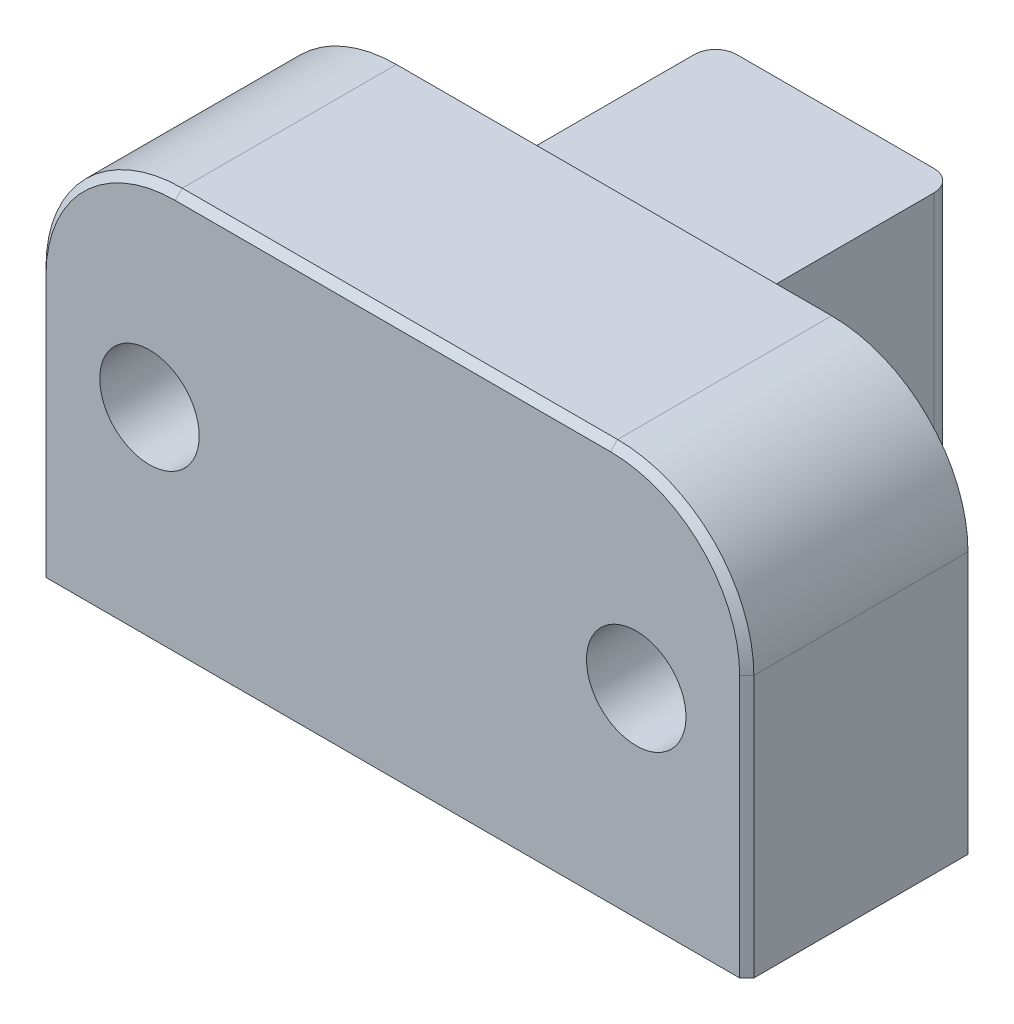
from build123d import *

# Parameters (mm, degrees)
EXTRUDE1_DEPTH     = 28.575
SKETCH3_W          = 25.4
SKETCH3_H          = 8.37699273
SKETCH3_H_2        = 7.62
CUT_EXTRUDE2_DEPTH = 12.7
FILLET2_R          = 1.524
FILLET3_R          = 0.7874
FILLET4_R          = 9.779
CHAMFER1_SIZE      = 0.508


with BuildPart() as part:
    # Sketch1 → Extrude1 (new body)
    with BuildSketch(Plane(origin=(0, 0, 0), x_dir=(1, 0, 0), z_dir=(0, 1, 0))):
        Polygon((-25.39365, 0), (-8.5979, 0), (-8.5979, 15.875), (8.5979, 15.875), (8.5979, 0), (25.39365, 0), (25.39365, -15.875), (-25.39365, -15.875), align=None)
    extrude(amount=EXTRUDE1_DEPTH)

    # Sketch3 → Cut-Extrude2 (cut, symmetric)
    with BuildSketch(Plane(origin=(0, 0, 0), x_dir=(0, 0, -1), z_dir=(1, 0, 0))):
        with Locations((12.7, -1.140496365)):
            Rectangle(SKETCH3_W, SKETCH3_H)
        with Locations((12.7, 29.337)):
            Rectangle(SKETCH3_W, SKETCH3_H_2)
    extrude(amount=CUT_EXTRUDE2_DEPTH, both=True, mode=Mode.SUBTRACT)

    # Fillet2
    fillet2_edges = [part.edges().sort_by_distance(p)[0] for p in [
        (-8.5979, 14.2875, -15.875),
        (8.5979, 14.2875, -15.875),
    ]]
    fillet(fillet2_edges, radius=FILLET2_R)

    # Fillet3
    fillet3_edges = [part.edges().sort_by_distance(p)[0] for p in [
        (8.5979, 14.2875, 0),
        (-8.5979, 14.2875, 0),
    ]]
    fillet(fillet3_edges, radius=FILLET3_R)

    # Fillet4
    fillet4_edges = [part.edges().sort_by_distance(p)[0] for p in [
        (25.39365, 28.575, 7.9375),
        (-25.39365, 28.575, 7.9375),
    ]]
    fillet(fillet4_edges, radius=FILLET4_R)

    # Sketch4 → Cut-Revolve1 (revolve, cut)
    with BuildSketch(Plane(origin=(0, 14.2875, 0), x_dir=(-1, 0, 0), z_dir=(0, 1, 0))):
        Polygon((17.4625, 15.875), (13.8938, 15.875), (13.8938, 6.7564), (12.3063, 6.7564), (12.3063, 0), (17.4625, 0), align=None)
    cut_revolve1 = revolve(axis=Axis((-17.4625, 14.2875, 26.865158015), (0, 0, -1)), mode=Mode.SUBTRACT)

    # Mirror1: Cut-Revolve1 across plane
    add(cut_revolve1.mirror(Plane(origin=(0, 0, 0), x_dir=(0, 0, 1), z_dir=(1, 0, 0))), mode=Mode.SUBTRACT)

    # Chamfer1
    chamfer1_edges = [part.edges().sort_by_distance(p)[0] for p in [
        (25.39365, 9.398, 15.875),
        (-25.39365, 9.398, 15.875),
        (-22.529447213, 25.710797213, 15.875),
        (22.529447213, 25.710797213, 15.875),
        (0, 28.575, 15.875),
    ]]
    chamfer(chamfer1_edges, length=CHAMFER1_SIZE)


solid = part.part
